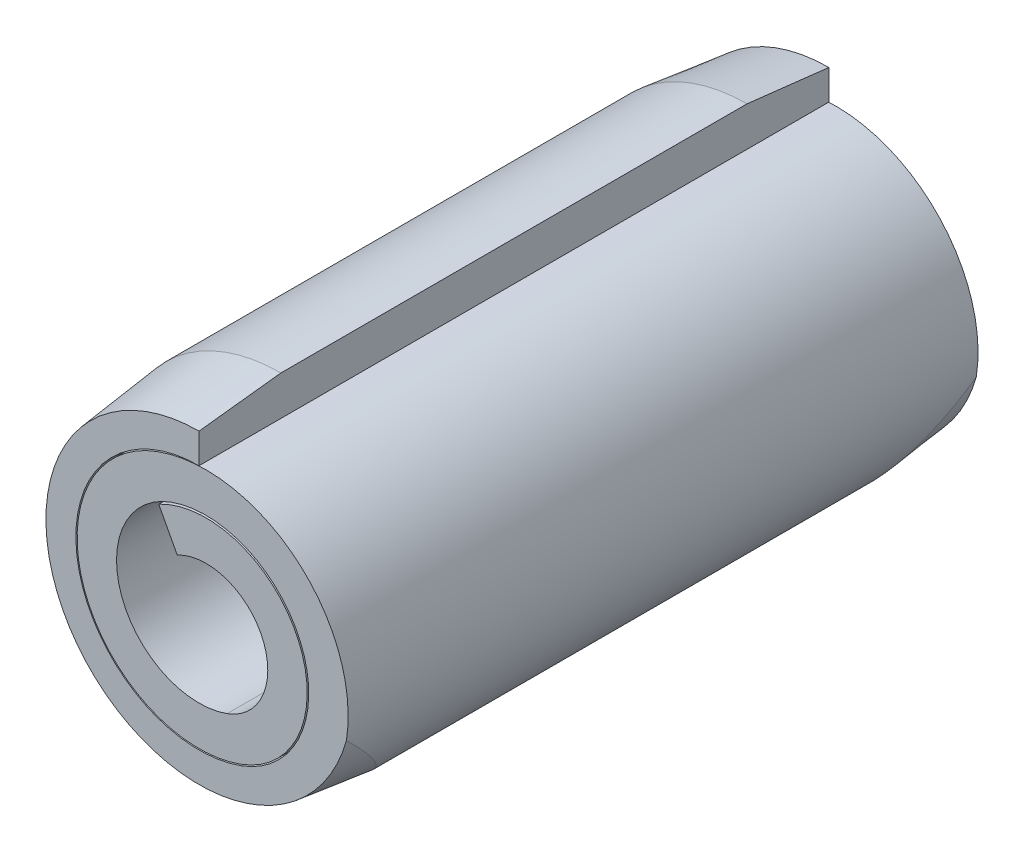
ISO-10303-21;
HEADER;
FILE_DESCRIPTION(('STEP AP214'),'2;1');
FILE_NAME('part.step','',(''),(''),'','','');
FILE_SCHEMA(('AUTOMOTIVE_DESIGN { 1 0 10303 214 1 1 1 1 }'));
ENDSEC;
DATA;
#1=APPLICATION_CONTEXT('core data for automotive mechanical design processes');
#2=APPLICATION_PROTOCOL_DEFINITION('international standard','automotive_design',2000,#1);
#3=PRODUCT_CONTEXT('',#1,'mechanical');
#4=PRODUCT('Part','Part','',(#3));
#5=PRODUCT_RELATED_PRODUCT_CATEGORY('part','',(#4));
#6=PRODUCT_DEFINITION_FORMATION('','',#4);
#7=PRODUCT_DEFINITION_CONTEXT('part definition',#1,'design');
#8=PRODUCT_DEFINITION('design','',#6,#7);
#9=PRODUCT_DEFINITION_SHAPE('','',#8);
#10=(LENGTH_UNIT() NAMED_UNIT(*) SI_UNIT(.MILLI.,.METRE.));
#11=(NAMED_UNIT(*) PLANE_ANGLE_UNIT() SI_UNIT($,.RADIAN.));
#12=(NAMED_UNIT(*) SI_UNIT($,.STERADIAN.) SOLID_ANGLE_UNIT());
#13=UNCERTAINTY_MEASURE_WITH_UNIT(LENGTH_MEASURE(1.E-05),#10,'distance_accuracy_value','');
#14=(GEOMETRIC_REPRESENTATION_CONTEXT(3) GLOBAL_UNCERTAINTY_ASSIGNED_CONTEXT((#13)) GLOBAL_UNIT_ASSIGNED_CONTEXT((#10,
#11,#12)) REPRESENTATION_CONTEXT('',''));
#15=CARTESIAN_POINT('',(0.,0.,0.));
#16=DIRECTION('',(0.,0.,1.));
#17=DIRECTION('',(1.,0.,0.));
#18=AXIS2_PLACEMENT_3D('',#15,#16,#17);
#19=CARTESIAN_POINT('',(0.143545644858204,-0.394388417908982,-6.35));
#20=DIRECTION('',(0.,0.,1.));
#21=DIRECTION('',(1.,0.,0.));
#22=AXIS2_PLACEMENT_3D('',#19,#20,#21);
#23=CYLINDRICAL_SURFACE('',#22,2.03775061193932);
#24=CARTESIAN_POINT('',(0.143545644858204,-0.394388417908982,6.35));
#25=DIRECTION('',(0.,0.,1.));
#26=DIRECTION('',(1.,0.,0.));
#27=AXIS2_PLACEMENT_3D('',#24,#25,#26);
#28=CIRCLE('',#27,2.03775061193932);
#29=CARTESIAN_POINT('',(0.840497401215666,-2.30924763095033,6.35));
#30=VERTEX_POINT('',#29);
#31=CARTESIAN_POINT('',(-0.811561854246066,1.40566636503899,6.35));
#32=VERTEX_POINT('',#31);
#33=EDGE_CURVE('E191',#30,#32,#28,.T.);
#34=ORIENTED_EDGE('',*,*,#33,.F.);
#35=DIRECTION('',(0.,0.,1.));
#36=VECTOR('',#35,1.);
#37=CARTESIAN_POINT('',(0.840497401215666,-2.30924763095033,-6.35));
#38=LINE('',#37,#36);
#39=CARTESIAN_POINT('',(0.840497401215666,-2.30924763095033,-6.35));
#40=VERTEX_POINT('',#39);
#41=EDGE_CURVE('E164',#40,#30,#38,.T.);
#42=ORIENTED_EDGE('',*,*,#41,.F.);
#43=CARTESIAN_POINT('',(0.143545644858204,-0.394388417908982,-6.35));
#44=DIRECTION('',(0.,0.,1.));
#45=DIRECTION('',(1.,0.,0.));
#46=AXIS2_PLACEMENT_3D('',#43,#44,#45);
#47=CIRCLE('',#46,2.03775061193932);
#48=CARTESIAN_POINT('',(-0.811561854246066,1.40566636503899,-6.35));
#49=VERTEX_POINT('',#48);
#50=EDGE_CURVE('E175',#40,#49,#47,.T.);
#51=ORIENTED_EDGE('',*,*,#50,.T.);
#52=DIRECTION('',(0.,0.,1.));
#53=VECTOR('',#52,1.);
#54=CARTESIAN_POINT('',(-0.811561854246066,1.40566636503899,-6.35));
#55=LINE('',#54,#53);
#56=EDGE_CURVE('E162',#49,#32,#55,.T.);
#57=ORIENTED_EDGE('',*,*,#56,.T.);
#58=EDGE_LOOP('',(#34,#42,#51,#57));
#59=FACE_BOUND('',#58,.T.);
#60=ADVANCED_FACE('F35',(#59),#23,.T.);
#61=CARTESIAN_POINT('',(0.,0.,-6.35));
#62=DIRECTION('',(0.,0.,1.));
#63=DIRECTION('',(1.,0.,0.));
#64=AXIS2_PLACEMENT_3D('',#61,#62,#63);
#65=CYLINDRICAL_SURFACE('',#64,2.45745);
#66=CARTESIAN_POINT('',(0.,0.,6.35));
#67=DIRECTION('',(0.,0.,1.));
#68=DIRECTION('',(1.,0.,0.));
#69=AXIS2_PLACEMENT_3D('',#66,#67,#68);
#70=CIRCLE('',#69,2.45745);
#71=CARTESIAN_POINT('',(-0.840497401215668,2.30924763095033,6.35));
#72=VERTEX_POINT('',#71);
#73=EDGE_CURVE('E172',#72,#30,#70,.T.);
#74=ORIENTED_EDGE('',*,*,#73,.F.);
#75=DIRECTION('',(0.,0.,1.));
#76=VECTOR('',#75,1.);
#77=CARTESIAN_POINT('',(-0.840497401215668,2.30924763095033,-6.35));
#78=LINE('',#77,#76);
#79=CARTESIAN_POINT('',(-0.840497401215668,2.30924763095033,-6.35));
#80=VERTEX_POINT('',#79);
#81=EDGE_CURVE('E144',#80,#72,#78,.T.);
#82=ORIENTED_EDGE('',*,*,#81,.F.);
#83=CARTESIAN_POINT('',(0.,0.,-6.35));
#84=DIRECTION('',(0.,0.,1.));
#85=DIRECTION('',(1.,0.,0.));
#86=AXIS2_PLACEMENT_3D('',#83,#84,#85);
#87=CIRCLE('',#86,2.45745);
#88=EDGE_CURVE('E163',#80,#40,#87,.T.);
#89=ORIENTED_EDGE('',*,*,#88,.T.);
#90=ORIENTED_EDGE('',*,*,#41,.T.);
#91=EDGE_LOOP('',(#74,#82,#89,#90));
#92=FACE_BOUND('',#91,.T.);
#93=ADVANCED_FACE('F236',(#92),#65,.T.);
#94=CARTESIAN_POINT('',(0.140082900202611,-0.384874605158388,-6.35));
#95=DIRECTION('',(0.,0.,1.));
#96=DIRECTION('',(1.,0.,0.));
#97=AXIS2_PLACEMENT_3D('',#94,#95,#96);
#98=CYLINDRICAL_SURFACE('',#97,2.867025);
#99=CARTESIAN_POINT('',(-0.942121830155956,-3.03980685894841,-5.514924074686));
#100=CARTESIAN_POINT('',(-0.875660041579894,-3.06687529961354,-5.46119828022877));
#101=CARTESIAN_POINT('',(-0.807173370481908,-3.09189953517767,-5.40900171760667));
#102=CARTESIAN_POINT('',(-0.66590112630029,-3.13728903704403,-5.30810728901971));
#103=CARTESIAN_POINT('',(-0.593104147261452,-3.15764117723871,-5.25941953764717));
#104=CARTESIAN_POINT('',(-0.367425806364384,-3.21085727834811,-5.11908888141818));
#105=CARTESIAN_POINT('',(-0.208160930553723,-3.23549395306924,-5.03392727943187));
#106=CARTESIAN_POINT('',(0.0648213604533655,-3.25293791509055,-4.91391356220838));
#107=CARTESIAN_POINT('',(0.174915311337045,-3.25387964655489,-4.87189324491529));
#108=CARTESIAN_POINT('',(0.398159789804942,-3.24243345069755,-4.80048375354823));
#109=CARTESIAN_POINT('',(0.511297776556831,-3.23009387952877,-4.77104929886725));
#110=CARTESIAN_POINT('',(0.738820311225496,-3.19107306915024,-4.72639159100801));
#111=CARTESIAN_POINT('',(0.853208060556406,-3.16429286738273,-4.7112684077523));
#112=CARTESIAN_POINT('',(1.07879584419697,-3.09642713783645,-4.69676778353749));
#113=CARTESIAN_POINT('',(1.18999427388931,-3.05533454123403,-4.69739813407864));
#114=CARTESIAN_POINT('',(1.39874686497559,-2.9632106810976,-4.71383723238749));
#115=CARTESIAN_POINT('',(1.49671955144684,-2.91295013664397,-4.7287059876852));
#116=CARTESIAN_POINT('',(1.6841894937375,-2.80301156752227,-4.77123833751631));
#117=CARTESIAN_POINT('',(1.77368524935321,-2.74333188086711,-4.7989041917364));
#118=CARTESIAN_POINT('',(1.94626879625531,-2.61414072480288,-4.86679361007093));
#119=CARTESIAN_POINT('',(2.0289404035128,-2.54432539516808,-4.9074877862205));
#120=CARTESIAN_POINT('',(2.18298043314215,-2.39922684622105,-4.99894153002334));
#121=CARTESIAN_POINT('',(2.25434916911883,-2.323943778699,-5.04970081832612));
#122=CARTESIAN_POINT('',(2.4235887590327,-2.12578819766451,-5.19073207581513));
#123=CARTESIAN_POINT('',(2.51335255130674,-2.00026699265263,-5.28702602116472));
#124=CARTESIAN_POINT('',(2.66827731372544,-1.74521422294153,-5.49431285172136));
#125=CARTESIAN_POINT('',(2.73328563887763,-1.61566294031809,-5.6053914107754));
#126=CARTESIAN_POINT('',(2.826867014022,-1.39070115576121,-5.80698586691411));
#127=CARTESIAN_POINT('',(2.86052651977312,-1.29528080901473,-5.89521736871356));
#128=CARTESIAN_POINT('',(2.91692200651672,-1.1051774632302,-6.07603946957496));
#129=CARTESIAN_POINT('',(2.93964703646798,-1.01049529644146,-6.16863433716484));
#130=CARTESIAN_POINT('',(2.9748175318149,-0.824152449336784,-6.35559665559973));
#131=CARTESIAN_POINT('',(2.98742437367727,-0.732467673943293,-6.44991068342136));
#132=CARTESIAN_POINT('',(3.00371777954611,-0.551167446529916,-6.64085076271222));
#133=CARTESIAN_POINT('',(3.00742516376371,-0.461547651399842,-6.7374708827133));
#134=CARTESIAN_POINT('',(3.00708354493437,-0.373057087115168,-6.83502296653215));
#135=B_SPLINE_CURVE_WITH_KNOTS('',3,(#99,#100,#101,#102,#103,#104,#105,#106,#107,#108,#109,#110,
#111,#112,#113,#114,#115,#116,#117,#118,#119,#120,#121,#122,#123,#124,#125,#126,#127,#128,#129,
#130,#131,#132,#133,#134),.UNSPECIFIED.,.F.,.F.,(4,2,2,2,2,2,2,2,2,2,2,2,2,2,2,2,2,4),(0.,
0.268780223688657,0.538306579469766,1.08102283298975,1.43333556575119,1.7843698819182,
2.1378410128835,2.49148696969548,2.82328780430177,3.15514725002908,3.50068561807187,
3.84621439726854,4.3888555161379,4.93479043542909,5.33701217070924,5.73963590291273,
6.1357028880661,6.53084237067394),.UNSPECIFIED.);
#136=CARTESIAN_POINT('',(2.97227947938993,-0.830402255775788,-6.35));
#137=VERTEX_POINT('',#136);
#138=CARTESIAN_POINT('',(1.12066320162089,-3.07899684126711,-4.699));
#139=VERTEX_POINT('',#138);
#140=EDGE_CURVE('E124',#137,#139,#135,.F.);
#141=ORIENTED_EDGE('',*,*,#140,.F.);
#142=CARTESIAN_POINT('',(0.140082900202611,-0.384874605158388,-6.35));
#143=DIRECTION('',(0.,0.,1.));
#144=DIRECTION('',(1.,0.,0.));
#145=AXIS2_PLACEMENT_3D('',#142,#143,#144);
#146=CIRCLE('',#145,2.867025);
#147=EDGE_CURVE('E195',#137,#80,#146,.T.);
#148=ORIENTED_EDGE('',*,*,#147,.T.);
#149=ORIENTED_EDGE('',*,*,#81,.T.);
#150=CARTESIAN_POINT('',(0.140082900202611,-0.384874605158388,6.35));
#151=DIRECTION('',(0.,0.,1.));
#152=DIRECTION('',(1.,0.,0.));
#153=AXIS2_PLACEMENT_3D('',#150,#151,#152);
#154=CIRCLE('',#153,2.867025);
#155=CARTESIAN_POINT('',(2.97227947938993,-0.830402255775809,6.35));
#156=VERTEX_POINT('',#155);
#157=EDGE_CURVE('E176',#156,#72,#154,.T.);
#158=ORIENTED_EDGE('',*,*,#157,.F.);
#159=CARTESIAN_POINT('',(-0.942121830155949,-3.03980685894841,5.51492407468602));
#160=CARTESIAN_POINT('',(-0.875660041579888,-3.06687529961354,5.46119828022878));
#161=CARTESIAN_POINT('',(-0.807173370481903,-3.09189953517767,5.40900171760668));
#162=CARTESIAN_POINT('',(-0.665901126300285,-3.13728903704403,5.30810728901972));
#163=CARTESIAN_POINT('',(-0.593104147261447,-3.15764117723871,5.25941953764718));
#164=CARTESIAN_POINT('',(-0.367425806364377,-3.21085727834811,5.11908888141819));
#165=CARTESIAN_POINT('',(-0.208160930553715,-3.23549395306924,5.03392727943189));
#166=CARTESIAN_POINT('',(0.0648213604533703,-3.25293791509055,4.91391356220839));
#167=CARTESIAN_POINT('',(0.174915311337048,-3.25387964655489,4.87189324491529));
#168=CARTESIAN_POINT('',(0.398159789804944,-3.24243345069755,4.80048375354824));
#169=CARTESIAN_POINT('',(0.511297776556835,-3.23009387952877,4.77104929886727));
#170=CARTESIAN_POINT('',(0.738820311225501,-3.19107306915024,4.72639159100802));
#171=CARTESIAN_POINT('',(0.85320806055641,-3.16429286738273,4.7112684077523));
#172=CARTESIAN_POINT('',(1.07879584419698,-3.09642713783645,4.69676778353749));
#173=CARTESIAN_POINT('',(1.18999427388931,-3.05533454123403,4.69739813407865));
#174=CARTESIAN_POINT('',(1.39874686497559,-2.9632106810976,4.71383723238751));
#175=CARTESIAN_POINT('',(1.49671955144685,-2.91295013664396,4.72870598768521));
#176=CARTESIAN_POINT('',(1.68418949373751,-2.80301156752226,4.77123833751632));
#177=CARTESIAN_POINT('',(1.77368524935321,-2.74333188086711,4.79890419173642));
#178=CARTESIAN_POINT('',(1.94626879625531,-2.61414072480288,4.86679361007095));
#179=CARTESIAN_POINT('',(2.02894040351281,-2.54432539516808,4.90748778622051));
#180=CARTESIAN_POINT('',(2.18298043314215,-2.39922684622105,4.99894153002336));
#181=CARTESIAN_POINT('',(2.25434916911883,-2.323943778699,5.04970081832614));
#182=CARTESIAN_POINT('',(2.4235887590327,-2.12578819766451,5.19073207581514));
#183=CARTESIAN_POINT('',(2.51335255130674,-2.00026699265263,5.28702602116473));
#184=CARTESIAN_POINT('',(2.66827731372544,-1.74521422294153,5.49431285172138));
#185=CARTESIAN_POINT('',(2.73328563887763,-1.61566294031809,5.60539141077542));
#186=CARTESIAN_POINT('',(2.826867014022,-1.39070115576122,5.80698586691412));
#187=CARTESIAN_POINT('',(2.86052651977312,-1.29528080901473,5.89521736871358));
#188=CARTESIAN_POINT('',(2.91692200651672,-1.1051774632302,6.07603946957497));
#189=CARTESIAN_POINT('',(2.93964703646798,-1.01049529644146,6.16863433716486));
#190=CARTESIAN_POINT('',(2.9748175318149,-0.824152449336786,6.35559665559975));
#191=CARTESIAN_POINT('',(2.98742437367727,-0.732467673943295,6.44991068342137));
#192=CARTESIAN_POINT('',(3.00371777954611,-0.551167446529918,6.64085076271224));
#193=CARTESIAN_POINT('',(3.00742516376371,-0.461547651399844,6.73747088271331));
#194=CARTESIAN_POINT('',(3.00708354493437,-0.373057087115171,6.83502296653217));
#195=B_SPLINE_CURVE_WITH_KNOTS('',3,(#159,#160,#161,#162,#163,#164,#165,#166,#167,#168,#169,
#170,#171,#172,#173,#174,#175,#176,#177,#178,#179,#180,#181,#182,#183,#184,#185,#186,#187,#188,
#189,#190,#191,#192,#193,#194),.UNSPECIFIED.,.F.,.F.,(4,2,2,2,2,2,2,2,2,2,2,2,2,2,2,2,2,4),(0.,
0.268780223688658,0.538306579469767,1.08102283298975,1.43333556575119,1.7843698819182,
2.1378410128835,2.49148696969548,2.82328780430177,3.15514725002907,3.50068561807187,
3.84621439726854,4.3888555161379,4.93479043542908,5.33701217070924,5.73963590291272,
6.13570288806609,6.53084237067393),.UNSPECIFIED.);
#196=CARTESIAN_POINT('',(1.12066320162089,-3.07899684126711,4.699));
#197=VERTEX_POINT('',#196);
#198=EDGE_CURVE('E56',#197,#156,#195,.T.);
#199=ORIENTED_EDGE('',*,*,#198,.F.);
#200=DIRECTION('',(0.,0.,1.));
#201=VECTOR('',#200,1.);
#202=CARTESIAN_POINT('',(1.12066320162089,-3.07899684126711,-6.35));
#203=LINE('',#202,#201);
#204=EDGE_CURVE('E141',#139,#197,#203,.T.);
#205=ORIENTED_EDGE('',*,*,#204,.F.);
#206=EDGE_LOOP('',(#141,#148,#149,#158,#199,#205));
#207=FACE_BOUND('',#206,.T.);
#208=ADVANCED_FACE('F218',(#207),#98,.T.);
#209=CARTESIAN_POINT('',(0.,0.,-6.35));
#210=DIRECTION('',(0.,0.,1.));
#211=DIRECTION('',(1.,0.,0.));
#212=AXIS2_PLACEMENT_3D('',#209,#210,#211);
#213=CYLINDRICAL_SURFACE('',#212,3.2766);
#214=CARTESIAN_POINT('',(0.,0.,-4.699));
#215=DIRECTION('',(0.,0.,-1.));
#216=DIRECTION('',(0.,1.,0.));
#217=AXIS2_PLACEMENT_3D('',#214,#215,#216);
#218=CIRCLE('',#217,3.2766);
#219=CARTESIAN_POINT('',(0.,3.2766,-4.699));
#220=VERTEX_POINT('',#219);
#221=EDGE_CURVE('E121',#139,#220,#218,.T.);
#222=ORIENTED_EDGE('',*,*,#221,.F.);
#223=ORIENTED_EDGE('',*,*,#204,.T.);
#224=CARTESIAN_POINT('',(0.,0.,4.699));
#225=DIRECTION('',(0.,0.,-1.));
#226=DIRECTION('',(0.,1.,0.));
#227=AXIS2_PLACEMENT_3D('',#224,#225,#226);
#228=CIRCLE('',#227,3.2766);
#229=CARTESIAN_POINT('',(0.,3.2766,4.699));
#230=VERTEX_POINT('',#229);
#231=EDGE_CURVE('E140',#197,#230,#228,.T.);
#232=ORIENTED_EDGE('',*,*,#231,.T.);
#233=DIRECTION('',(0.,0.,1.));
#234=VECTOR('',#233,1.);
#235=CARTESIAN_POINT('',(0.,3.2766,-6.35));
#236=LINE('',#235,#234);
#237=EDGE_CURVE('E133',#220,#230,#236,.T.);
#238=ORIENTED_EDGE('',*,*,#237,.F.);
#239=EDGE_LOOP('',(#222,#223,#232,#238));
#240=FACE_BOUND('',#239,.T.);
#241=ADVANCED_FACE('F139',(#240),#213,.T.);
#242=CARTESIAN_POINT('',(0.,3.2766,-6.35));
#243=DIRECTION('',(-1.,0.,0.));
#244=DIRECTION('',(0.,-1.,0.));
#245=AXIS2_PLACEMENT_3D('',#242,#243,#244);
#246=PLANE('',#245);
#247=DIRECTION('',(0.,-1.,0.));
#248=VECTOR('',#247,1.);
#249=CARTESIAN_POINT('',(0.,3.2766,-6.35));
#250=LINE('',#249,#248);
#251=CARTESIAN_POINT('',(0.,3.0861,-6.35));
#252=VERTEX_POINT('',#251);
#253=CARTESIAN_POINT('',(0.,2.4820245,-6.35));
#254=VERTEX_POINT('',#253);
#255=EDGE_CURVE('E136',#252,#254,#250,.T.);
#256=ORIENTED_EDGE('',*,*,#255,.F.);
#257=DIRECTION('',(0.,-0.114624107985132,-0.993408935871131));
#258=VECTOR('',#257,1.);
#259=CARTESIAN_POINT('',(0.,0.,-33.0961999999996));
#260=LINE('',#259,#258);
#261=EDGE_CURVE('E49',#252,#220,#260,.F.);
#262=ORIENTED_EDGE('',*,*,#261,.T.);
#263=ORIENTED_EDGE('',*,*,#237,.T.);
#264=DIRECTION('',(0.,0.114624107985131,-0.993408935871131));
#265=VECTOR('',#264,1.);
#266=CARTESIAN_POINT('',(0.,0.,33.0961999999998));
#267=LINE('',#266,#265);
#268=CARTESIAN_POINT('',(0.,3.0861,6.35));
#269=VERTEX_POINT('',#268);
#270=EDGE_CURVE('E216',#230,#269,#267,.F.);
#271=ORIENTED_EDGE('',*,*,#270,.T.);
#272=DIRECTION('',(0.,-1.,0.));
#273=VECTOR('',#272,1.);
#274=CARTESIAN_POINT('',(0.,3.2766,6.35));
#275=LINE('',#274,#273);
#276=CARTESIAN_POINT('',(0.,2.4820245,6.35));
#277=VERTEX_POINT('',#276);
#278=EDGE_CURVE('E178',#269,#277,#275,.T.);
#279=ORIENTED_EDGE('',*,*,#278,.T.);
#280=DIRECTION('',(0.,0.,1.));
#281=VECTOR('',#280,1.);
#282=CARTESIAN_POINT('',(0.,2.4820245,-6.35));
#283=LINE('',#282,#281);
#284=EDGE_CURVE('E142',#254,#277,#283,.T.);
#285=ORIENTED_EDGE('',*,*,#284,.F.);
#286=EDGE_LOOP('',(#256,#262,#263,#271,#279,#285));
#287=FACE_BOUND('',#286,.T.);
#288=ADVANCED_FACE('F131',(#287),#246,.F.);
#289=CARTESIAN_POINT('',(0.,0.,-6.35));
#290=DIRECTION('',(0.,0.,1.));
#291=DIRECTION('',(1.,0.,0.));
#292=AXIS2_PLACEMENT_3D('',#289,#290,#291);
#293=CYLINDRICAL_SURFACE('',#292,2.4820245);
#294=CARTESIAN_POINT('',(0.,0.,6.35));
#295=DIRECTION('',(0.,0.,1.));
#296=DIRECTION('',(1.,0.,0.));
#297=AXIS2_PLACEMENT_3D('',#294,#295,#296);
#298=CIRCLE('',#297,2.4820245);
#299=CARTESIAN_POINT('',(0.848902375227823,-2.33234010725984,6.35));
#300=VERTEX_POINT('',#299);
#301=EDGE_CURVE('E180',#277,#300,#298,.T.);
#302=ORIENTED_EDGE('',*,*,#301,.T.);
#303=DIRECTION('',(0.,0.,1.));
#304=VECTOR('',#303,1.);
#305=CARTESIAN_POINT('',(0.848902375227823,-2.33234010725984,-6.35));
#306=LINE('',#305,#304);
#307=CARTESIAN_POINT('',(0.848902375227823,-2.33234010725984,-6.35));
#308=VERTEX_POINT('',#307);
#309=EDGE_CURVE('E147',#308,#300,#306,.T.);
#310=ORIENTED_EDGE('',*,*,#309,.F.);
#311=CARTESIAN_POINT('',(0.,0.,-6.35));
#312=DIRECTION('',(0.,0.,1.));
#313=DIRECTION('',(1.,0.,0.));
#314=AXIS2_PLACEMENT_3D('',#311,#312,#313);
#315=CIRCLE('',#314,2.4820245);
#316=EDGE_CURVE('E198',#254,#308,#315,.T.);
#317=ORIENTED_EDGE('',*,*,#316,.F.);
#318=ORIENTED_EDGE('',*,*,#284,.T.);
#319=EDGE_LOOP('',(#302,#310,#317,#318));
#320=FACE_BOUND('',#319,.T.);
#321=ADVANCED_FACE('F272',(#320),#293,.F.);
#322=CARTESIAN_POINT('',(0.140082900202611,-0.384874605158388,-6.35));
#323=DIRECTION('',(0.,0.,1.));
#324=DIRECTION('',(1.,0.,0.));
#325=AXIS2_PLACEMENT_3D('',#322,#323,#324);
#326=CYLINDRICAL_SURFACE('',#325,2.0724495);
#327=CARTESIAN_POINT('',(0.140082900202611,-0.384874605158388,6.35));
#328=DIRECTION('',(0.,0.,1.));
#329=DIRECTION('',(1.,0.,0.));
#330=AXIS2_PLACEMENT_3D('',#327,#328,#329);
#331=CIRCLE('',#330,2.0724495);
#332=CARTESIAN_POINT('',(-0.568736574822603,1.56259089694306,6.35));
#333=VERTEX_POINT('',#332);
#334=EDGE_CURVE('E182',#300,#333,#331,.T.);
#335=ORIENTED_EDGE('',*,*,#334,.T.);
#336=DIRECTION('',(0.,0.,1.));
#337=VECTOR('',#336,1.);
#338=CARTESIAN_POINT('',(-0.568736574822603,1.56259089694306,-6.35));
#339=LINE('',#338,#337);
#340=CARTESIAN_POINT('',(-0.568736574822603,1.56259089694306,-6.35));
#341=VERTEX_POINT('',#340);
#342=EDGE_CURVE('E153',#341,#333,#339,.T.);
#343=ORIENTED_EDGE('',*,*,#342,.F.);
#344=CARTESIAN_POINT('',(0.140082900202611,-0.384874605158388,-6.35));
#345=DIRECTION('',(0.,0.,1.));
#346=DIRECTION('',(1.,0.,0.));
#347=AXIS2_PLACEMENT_3D('',#344,#345,#346);
#348=CIRCLE('',#347,2.0724495);
#349=EDGE_CURVE('E200',#308,#341,#348,.T.);
#350=ORIENTED_EDGE('',*,*,#349,.F.);
#351=ORIENTED_EDGE('',*,*,#309,.T.);
#352=EDGE_LOOP('',(#335,#343,#350,#351));
#353=FACE_BOUND('',#352,.T.);
#354=ADVANCED_FACE('F268',(#353),#326,.F.);
#355=CARTESIAN_POINT('',(0.,0.,-6.35));
#356=DIRECTION('',(0.,0.,1.));
#357=DIRECTION('',(1.,0.,0.));
#358=AXIS2_PLACEMENT_3D('',#355,#356,#357);
#359=CYLINDRICAL_SURFACE('',#358,1.6628745);
#360=CARTESIAN_POINT('',(0.,0.,6.35));
#361=DIRECTION('',(0.,0.,1.));
#362=DIRECTION('',(1.,0.,0.));
#363=AXIS2_PLACEMENT_3D('',#360,#361,#362);
#364=CIRCLE('',#363,1.6628745);
#365=CARTESIAN_POINT('',(0.568736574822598,-1.56259089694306,6.35));
#366=VERTEX_POINT('',#365);
#367=EDGE_CURVE('E184',#333,#366,#364,.T.);
#368=ORIENTED_EDGE('',*,*,#367,.T.);
#369=DIRECTION('',(0.,0.,1.));
#370=VECTOR('',#369,1.);
#371=CARTESIAN_POINT('',(0.568736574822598,-1.56259089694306,-6.35));
#372=LINE('',#371,#370);
#373=CARTESIAN_POINT('',(0.568736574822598,-1.56259089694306,-6.35));
#374=VERTEX_POINT('',#373);
#375=EDGE_CURVE('E156',#374,#366,#372,.T.);
#376=ORIENTED_EDGE('',*,*,#375,.F.);
#377=CARTESIAN_POINT('',(0.,0.,-6.35));
#378=DIRECTION('',(0.,0.,1.));
#379=DIRECTION('',(1.,0.,0.));
#380=AXIS2_PLACEMENT_3D('',#377,#378,#379);
#381=CIRCLE('',#380,1.6628745);
#382=EDGE_CURVE('E202',#341,#374,#381,.T.);
#383=ORIENTED_EDGE('',*,*,#382,.F.);
#384=ORIENTED_EDGE('',*,*,#342,.T.);
#385=EDGE_LOOP('',(#368,#376,#383,#384));
#386=FACE_BOUND('',#385,.T.);
#387=ADVANCED_FACE('F264',(#386),#359,.F.);
#388=CARTESIAN_POINT('',(0.143545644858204,-0.394388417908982,-6.35));
#389=DIRECTION('',(0.,0.,1.));
#390=DIRECTION('',(1.,0.,0.));
#391=AXIS2_PLACEMENT_3D('',#388,#389,#390);
#392=CYLINDRICAL_SURFACE('',#391,1.24317511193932);
#393=CARTESIAN_POINT('',(0.143545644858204,-0.394388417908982,6.35));
#394=DIRECTION('',(0.,0.,1.));
#395=DIRECTION('',(1.,0.,0.));
#396=AXIS2_PLACEMENT_3D('',#393,#394,#395);
#397=CIRCLE('',#396,1.24317511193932);
#398=CARTESIAN_POINT('',(-0.439138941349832,0.703775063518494,6.35));
#399=VERTEX_POINT('',#398);
#400=EDGE_CURVE('E186',#366,#399,#397,.T.);
#401=ORIENTED_EDGE('',*,*,#400,.T.);
#402=DIRECTION('',(0.,0.,1.));
#403=VECTOR('',#402,1.);
#404=CARTESIAN_POINT('',(-0.439138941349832,0.703775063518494,-6.35));
#405=LINE('',#404,#403);
#406=CARTESIAN_POINT('',(-0.439138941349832,0.703775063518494,-6.35));
#407=VERTEX_POINT('',#406);
#408=EDGE_CURVE('E159',#407,#399,#405,.T.);
#409=ORIENTED_EDGE('',*,*,#408,.F.);
#410=CARTESIAN_POINT('',(0.143545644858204,-0.394388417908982,-6.35));
#411=DIRECTION('',(0.,0.,1.));
#412=DIRECTION('',(1.,0.,0.));
#413=AXIS2_PLACEMENT_3D('',#410,#411,#412);
#414=CIRCLE('',#413,1.24317511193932);
#415=EDGE_CURVE('E204',#374,#407,#414,.T.);
#416=ORIENTED_EDGE('',*,*,#415,.F.);
#417=ORIENTED_EDGE('',*,*,#375,.T.);
#418=EDGE_LOOP('',(#401,#409,#416,#417));
#419=FACE_BOUND('',#418,.T.);
#420=ADVANCED_FACE('F259',(#419),#392,.F.);
#421=CARTESIAN_POINT('',(-0.439138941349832,0.703775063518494,-6.35));
#422=DIRECTION('',(0.883353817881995,0.468706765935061,0.));
#423=DIRECTION('',(-0.468706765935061,0.883353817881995,0.));
#424=AXIS2_PLACEMENT_3D('',#421,#422,#423);
#425=PLANE('',#424);
#426=DIRECTION('',(-0.468706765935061,0.883353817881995,0.));
#427=VECTOR('',#426,1.);
#428=CARTESIAN_POINT('',(-0.439138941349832,0.703775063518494,6.35));
#429=LINE('',#428,#427);
#430=EDGE_CURVE('E188',#399,#32,#429,.T.);
#431=ORIENTED_EDGE('',*,*,#430,.T.);
#432=ORIENTED_EDGE('',*,*,#56,.F.);
#433=DIRECTION('',(-0.468706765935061,0.883353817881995,0.));
#434=VECTOR('',#433,1.);
#435=CARTESIAN_POINT('',(-0.439138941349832,0.703775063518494,-6.35));
#436=LINE('',#435,#434);
#437=EDGE_CURVE('E206',#407,#49,#436,.T.);
#438=ORIENTED_EDGE('',*,*,#437,.F.);
#439=ORIENTED_EDGE('',*,*,#408,.T.);
#440=EDGE_LOOP('',(#431,#432,#438,#439));
#441=FACE_BOUND('',#440,.T.);
#442=ADVANCED_FACE('F232',(#441),#425,.F.);
#443=CARTESIAN_POINT('',(0.143545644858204,-0.394388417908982,-6.35));
#444=DIRECTION('',(0.,0.,1.));
#445=DIRECTION('',(1.,0.,0.));
#446=AXIS2_PLACEMENT_3D('',#443,#444,#445);
#447=PLANE('',#446);
#448=ORIENTED_EDGE('',*,*,#147,.F.);
#449=CARTESIAN_POINT('',(0.,0.,-6.35));
#450=DIRECTION('',(0.,0.,1.));
#451=DIRECTION('',(1.,0.,0.));
#452=AXIS2_PLACEMENT_3D('',#449,#450,#451);
#453=CIRCLE('',#452,3.0861);
#454=EDGE_CURVE('E11',#137,#252,#453,.F.);
#455=ORIENTED_EDGE('',*,*,#454,.T.);
#456=ORIENTED_EDGE('',*,*,#255,.T.);
#457=ORIENTED_EDGE('',*,*,#316,.T.);
#458=ORIENTED_EDGE('',*,*,#349,.T.);
#459=ORIENTED_EDGE('',*,*,#382,.T.);
#460=ORIENTED_EDGE('',*,*,#415,.T.);
#461=ORIENTED_EDGE('',*,*,#437,.T.);
#462=ORIENTED_EDGE('',*,*,#50,.F.);
#463=ORIENTED_EDGE('',*,*,#88,.F.);
#464=EDGE_LOOP('',(#448,#455,#456,#457,#458,#459,#460,#461,#462,#463));
#465=FACE_BOUND('',#464,.T.);
#466=ADVANCED_FACE('F229',(#465),#447,.F.);
#467=CARTESIAN_POINT('',(0.143545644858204,-0.394388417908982,6.35));
#468=DIRECTION('',(0.,0.,1.));
#469=DIRECTION('',(1.,0.,0.));
#470=AXIS2_PLACEMENT_3D('',#467,#468,#469);
#471=PLANE('',#470);
#472=CARTESIAN_POINT('',(0.,0.,6.35));
#473=DIRECTION('',(0.,0.,1.));
#474=DIRECTION('',(1.,0.,0.));
#475=AXIS2_PLACEMENT_3D('',#472,#473,#474);
#476=CIRCLE('',#475,3.0861);
#477=EDGE_CURVE('E42',#156,#269,#476,.F.);
#478=ORIENTED_EDGE('',*,*,#477,.F.);
#479=ORIENTED_EDGE('',*,*,#157,.T.);
#480=ORIENTED_EDGE('',*,*,#73,.T.);
#481=ORIENTED_EDGE('',*,*,#33,.T.);
#482=ORIENTED_EDGE('',*,*,#430,.F.);
#483=ORIENTED_EDGE('',*,*,#400,.F.);
#484=ORIENTED_EDGE('',*,*,#367,.F.);
#485=ORIENTED_EDGE('',*,*,#334,.F.);
#486=ORIENTED_EDGE('',*,*,#301,.F.);
#487=ORIENTED_EDGE('',*,*,#278,.F.);
#488=EDGE_LOOP('',(#478,#479,#480,#481,#482,#483,#484,#485,#486,#487));
#489=FACE_BOUND('',#488,.T.);
#490=ADVANCED_FACE('F227',(#489),#471,.T.);
#491=CARTESIAN_POINT('',(0.,0.,6.35));
#492=DIRECTION('',(0.,0.,-1.));
#493=DIRECTION('',(0.,1.,0.));
#494=AXIS2_PLACEMENT_3D('',#491,#492,#493);
#495=CONICAL_SURFACE('',#494,3.0861,0.1148766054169);
#496=ORIENTED_EDGE('',*,*,#198,.T.);
#497=ORIENTED_EDGE('',*,*,#477,.T.);
#498=ORIENTED_EDGE('',*,*,#270,.F.);
#499=ORIENTED_EDGE('',*,*,#231,.F.);
#500=EDGE_LOOP('',(#496,#497,#498,#499));
#501=FACE_BOUND('',#500,.T.);
#502=ADVANCED_FACE('F222',(#501),#495,.T.);
#503=CARTESIAN_POINT('',(0.,0.,-4.699));
#504=DIRECTION('',(0.,0.,1.));
#505=DIRECTION('',(0.,-1.,0.));
#506=AXIS2_PLACEMENT_3D('',#503,#504,#505);
#507=CONICAL_SURFACE('',#506,3.2766,0.114876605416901);
#508=ORIENTED_EDGE('',*,*,#140,.T.);
#509=ORIENTED_EDGE('',*,*,#221,.T.);
#510=ORIENTED_EDGE('',*,*,#261,.F.);
#511=ORIENTED_EDGE('',*,*,#454,.F.);
#512=EDGE_LOOP('',(#508,#509,#510,#511));
#513=FACE_BOUND('',#512,.T.);
#514=ADVANCED_FACE('F122',(#513),#507,.T.);
#515=CLOSED_SHELL('',(#60,#93,#208,#241,#288,#321,#354,#387,#420,#442,#466,#490,#502,#514));
#516=MANIFOLD_SOLID_BREP('B2',#515);
#517=ADVANCED_BREP_SHAPE_REPRESENTATION('',(#18,#516),#14);
#518=SHAPE_DEFINITION_REPRESENTATION(#9,#517);
ENDSEC;
END-ISO-10303-21;
